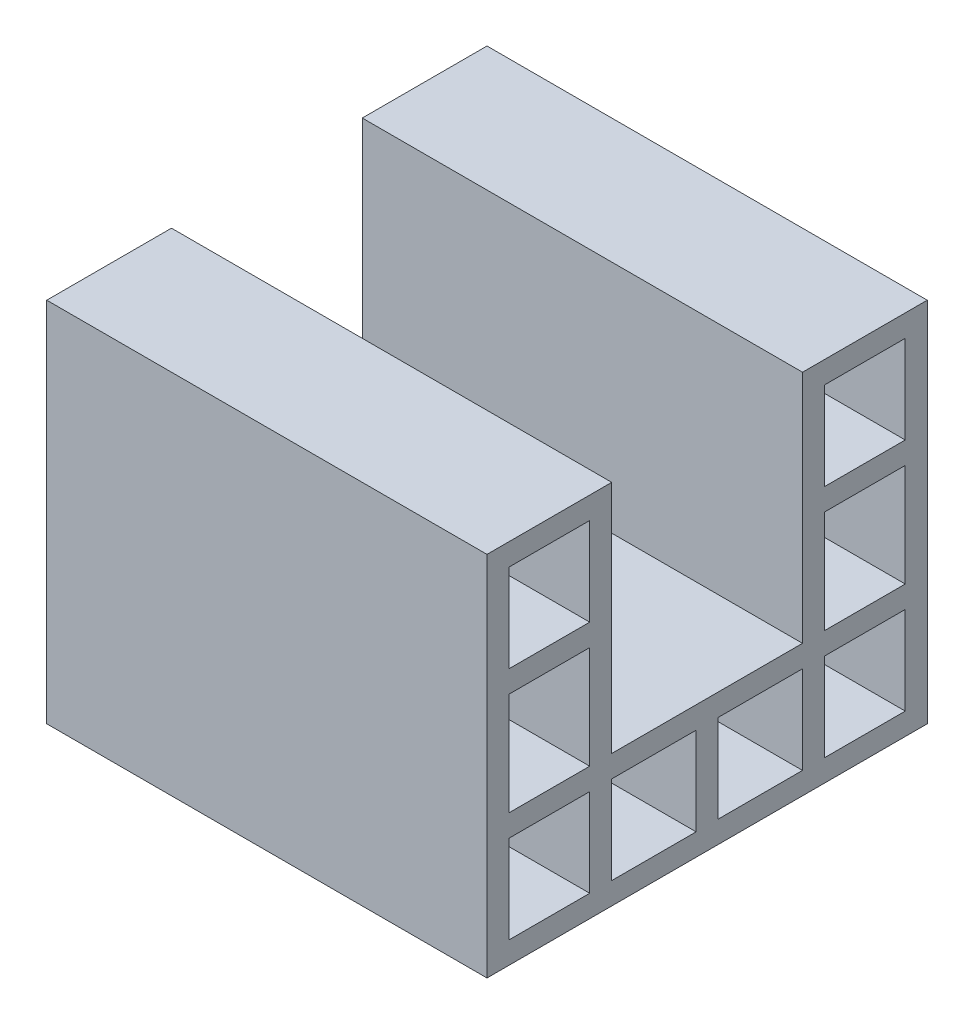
ISO-10303-21;
HEADER;
FILE_DESCRIPTION(('STEP AP214'),'2;1');
FILE_NAME('part.step','',(''),(''),'','','');
FILE_SCHEMA(('AUTOMOTIVE_DESIGN { 1 0 10303 214 1 1 1 1 }'));
ENDSEC;
DATA;
#1=APPLICATION_CONTEXT('core data for automotive mechanical design processes');
#2=APPLICATION_PROTOCOL_DEFINITION('international standard','automotive_design',2000,#1);
#3=PRODUCT_CONTEXT('',#1,'mechanical');
#4=PRODUCT('Part','Part','',(#3));
#5=PRODUCT_RELATED_PRODUCT_CATEGORY('part','',(#4));
#6=PRODUCT_DEFINITION_FORMATION('','',#4);
#7=PRODUCT_DEFINITION_CONTEXT('part definition',#1,'design');
#8=PRODUCT_DEFINITION('design','',#6,#7);
#9=PRODUCT_DEFINITION_SHAPE('','',#8);
#10=(LENGTH_UNIT() NAMED_UNIT(*) SI_UNIT(.MILLI.,.METRE.));
#11=(NAMED_UNIT(*) PLANE_ANGLE_UNIT() SI_UNIT($,.RADIAN.));
#12=(NAMED_UNIT(*) SI_UNIT($,.STERADIAN.) SOLID_ANGLE_UNIT());
#13=UNCERTAINTY_MEASURE_WITH_UNIT(LENGTH_MEASURE(1.E-05),#10,'distance_accuracy_value','');
#14=(GEOMETRIC_REPRESENTATION_CONTEXT(3) GLOBAL_UNCERTAINTY_ASSIGNED_CONTEXT((#13)) GLOBAL_UNIT_ASSIGNED_CONTEXT((#10,
#11,#12)) REPRESENTATION_CONTEXT('',''));
#15=CARTESIAN_POINT('',(0.,0.,0.));
#16=DIRECTION('',(0.,0.,1.));
#17=DIRECTION('',(1.,0.,0.));
#18=AXIS2_PLACEMENT_3D('',#15,#16,#17);
#19=CARTESIAN_POINT('',(30.,9.,-21.5));
#20=DIRECTION('',(-1.,0.,0.));
#21=DIRECTION('',(0.,0.,1.));
#22=AXIS2_PLACEMENT_3D('',#19,#20,#21);
#23=PLANE('',#22);
#24=DIRECTION('',(0.,0.,1.));
#25=VECTOR('',#24,1.);
#26=CARTESIAN_POINT('',(30.,16.,-28.5));
#27=LINE('',#26,#25);
#28=CARTESIAN_POINT('',(30.,16.,-28.5));
#29=VERTEX_POINT('',#28);
#30=CARTESIAN_POINT('',(30.,16.,-23.));
#31=VERTEX_POINT('',#30);
#32=EDGE_CURVE('E175',#29,#31,#27,.T.);
#33=ORIENTED_EDGE('',*,*,#32,.F.);
#34=DIRECTION('',(0.,1.,0.));
#35=VECTOR('',#34,1.);
#36=CARTESIAN_POINT('',(30.,16.,-28.5));
#37=LINE('',#36,#35);
#38=CARTESIAN_POINT('',(30.,9.,-28.5));
#39=VERTEX_POINT('',#38);
#40=EDGE_CURVE('E295',#39,#29,#37,.T.);
#41=ORIENTED_EDGE('',*,*,#40,.F.);
#42=DIRECTION('',(0.,0.,-1.));
#43=VECTOR('',#42,1.);
#44=CARTESIAN_POINT('',(30.,9.,-28.5));
#45=LINE('',#44,#43);
#46=CARTESIAN_POINT('',(30.,9.,-23.));
#47=VERTEX_POINT('',#46);
#48=EDGE_CURVE('E303',#47,#39,#45,.T.);
#49=ORIENTED_EDGE('',*,*,#48,.F.);
#50=DIRECTION('',(0.,-1.,0.));
#51=VECTOR('',#50,1.);
#52=CARTESIAN_POINT('',(30.,16.,-23.));
#53=LINE('',#52,#51);
#54=EDGE_CURVE('E307',#31,#47,#53,.T.);
#55=ORIENTED_EDGE('',*,*,#54,.F.);
#56=EDGE_LOOP('',(#33,#41,#49,#55));
#57=FACE_BOUND('',#56,.T.);
#58=DIRECTION('',(0.,0.,1.));
#59=VECTOR('',#58,1.);
#60=CARTESIAN_POINT('',(30.,7.5,-21.5));
#61=LINE('',#60,#59);
#62=CARTESIAN_POINT('',(30.,7.5,-21.5));
#63=VERTEX_POINT('',#62);
#64=CARTESIAN_POINT('',(30.,7.5,-15.75));
#65=VERTEX_POINT('',#64);
#66=EDGE_CURVE('E324',#63,#65,#61,.T.);
#67=ORIENTED_EDGE('',*,*,#66,.F.);
#68=DIRECTION('',(0.,1.,0.));
#69=VECTOR('',#68,1.);
#70=CARTESIAN_POINT('',(30.,7.5,-21.5));
#71=LINE('',#70,#69);
#72=CARTESIAN_POINT('',(30.,1.5,-21.5));
#73=VERTEX_POINT('',#72);
#74=EDGE_CURVE('E332',#73,#63,#71,.T.);
#75=ORIENTED_EDGE('',*,*,#74,.F.);
#76=DIRECTION('',(0.,0.,-1.));
#77=VECTOR('',#76,1.);
#78=CARTESIAN_POINT('',(30.,1.5,-21.5));
#79=LINE('',#78,#77);
#80=CARTESIAN_POINT('',(30.,1.5,-15.75));
#81=VERTEX_POINT('',#80);
#82=EDGE_CURVE('E329',#81,#73,#79,.T.);
#83=ORIENTED_EDGE('',*,*,#82,.F.);
#84=DIRECTION('',(0.,-1.,0.));
#85=VECTOR('',#84,1.);
#86=CARTESIAN_POINT('',(30.,7.5,-15.75));
#87=LINE('',#86,#85);
#88=EDGE_CURVE('E326',#65,#81,#87,.T.);
#89=ORIENTED_EDGE('',*,*,#88,.F.);
#90=EDGE_LOOP('',(#67,#75,#83,#89));
#91=FACE_BOUND('',#90,.T.);
#92=DIRECTION('',(0.,0.,-1.));
#93=VECTOR('',#92,1.);
#94=CARTESIAN_POINT('',(30.,17.5,-1.5));
#95=LINE('',#94,#93);
#96=CARTESIAN_POINT('',(30.,17.5,-1.5));
#97=VERTEX_POINT('',#96);
#98=CARTESIAN_POINT('',(30.,17.5,-7.));
#99=VERTEX_POINT('',#98);
#100=EDGE_CURVE('E346',#97,#99,#95,.T.);
#101=ORIENTED_EDGE('',*,*,#100,.F.);
#102=DIRECTION('',(0.,-1.,0.));
#103=VECTOR('',#102,1.);
#104=CARTESIAN_POINT('',(30.,17.5,-1.5));
#105=LINE('',#104,#103);
#106=CARTESIAN_POINT('',(30.,23.5,-1.5));
#107=VERTEX_POINT('',#106);
#108=EDGE_CURVE('E354',#107,#97,#105,.T.);
#109=ORIENTED_EDGE('',*,*,#108,.F.);
#110=DIRECTION('',(0.,0.,1.));
#111=VECTOR('',#110,1.);
#112=CARTESIAN_POINT('',(30.,23.5,-1.5));
#113=LINE('',#112,#111);
#114=CARTESIAN_POINT('',(30.,23.5,-7.));
#115=VERTEX_POINT('',#114);
#116=EDGE_CURVE('E351',#115,#107,#113,.T.);
#117=ORIENTED_EDGE('',*,*,#116,.F.);
#118=DIRECTION('',(0.,1.,0.));
#119=VECTOR('',#118,1.);
#120=CARTESIAN_POINT('',(30.,17.5,-7.));
#121=LINE('',#120,#119);
#122=EDGE_CURVE('E348',#99,#115,#121,.T.);
#123=ORIENTED_EDGE('',*,*,#122,.F.);
#124=EDGE_LOOP('',(#101,#109,#117,#123));
#125=FACE_BOUND('',#124,.T.);
#126=DIRECTION('',(0.,-1.,0.));
#127=VECTOR('',#126,1.);
#128=CARTESIAN_POINT('',(30.,7.5,-8.5));
#129=LINE('',#128,#127);
#130=CARTESIAN_POINT('',(30.,7.5,-8.5));
#131=VERTEX_POINT('',#130);
#132=CARTESIAN_POINT('',(30.,1.5,-8.5));
#133=VERTEX_POINT('',#132);
#134=EDGE_CURVE('E368',#131,#133,#129,.T.);
#135=ORIENTED_EDGE('',*,*,#134,.F.);
#136=DIRECTION('',(0.,0.,1.));
#137=VECTOR('',#136,1.);
#138=CARTESIAN_POINT('',(30.,7.5,-8.5));
#139=LINE('',#138,#137);
#140=CARTESIAN_POINT('',(30.,7.5,-14.25));
#141=VERTEX_POINT('',#140);
#142=EDGE_CURVE('E376',#141,#131,#139,.T.);
#143=ORIENTED_EDGE('',*,*,#142,.F.);
#144=DIRECTION('',(0.,1.,0.));
#145=VECTOR('',#144,1.);
#146=CARTESIAN_POINT('',(30.,7.5,-14.25));
#147=LINE('',#146,#145);
#148=CARTESIAN_POINT('',(30.,1.5,-14.25));
#149=VERTEX_POINT('',#148);
#150=EDGE_CURVE('E373',#149,#141,#147,.T.);
#151=ORIENTED_EDGE('',*,*,#150,.F.);
#152=DIRECTION('',(0.,0.,-1.));
#153=VECTOR('',#152,1.);
#154=CARTESIAN_POINT('',(30.,1.5,-8.5));
#155=LINE('',#154,#153);
#156=EDGE_CURVE('E370',#133,#149,#155,.T.);
#157=ORIENTED_EDGE('',*,*,#156,.F.);
#158=EDGE_LOOP('',(#135,#143,#151,#157));
#159=FACE_BOUND('',#158,.T.);
#160=DIRECTION('',(0.,-1.,0.));
#161=VECTOR('',#160,1.);
#162=CARTESIAN_POINT('',(30.,9.,-21.5));
#163=LINE('',#162,#161);
#164=CARTESIAN_POINT('',(30.,25.,-21.5));
#165=VERTEX_POINT('',#164);
#166=CARTESIAN_POINT('',(30.,9.,-21.5));
#167=VERTEX_POINT('',#166);
#168=EDGE_CURVE('E397',#165,#167,#163,.T.);
#169=ORIENTED_EDGE('',*,*,#168,.T.);
#170=DIRECTION('',(0.,0.,1.));
#171=VECTOR('',#170,1.);
#172=CARTESIAN_POINT('',(30.,9.,-8.5));
#173=LINE('',#172,#171);
#174=CARTESIAN_POINT('',(30.,9.,-8.5));
#175=VERTEX_POINT('',#174);
#176=EDGE_CURVE('E400',#167,#175,#173,.T.);
#177=ORIENTED_EDGE('',*,*,#176,.T.);
#178=DIRECTION('',(0.,1.,0.));
#179=VECTOR('',#178,1.);
#180=CARTESIAN_POINT('',(30.,9.,-8.5));
#181=LINE('',#180,#179);
#182=CARTESIAN_POINT('',(30.,25.,-8.5));
#183=VERTEX_POINT('',#182);
#184=EDGE_CURVE('E402',#175,#183,#181,.T.);
#185=ORIENTED_EDGE('',*,*,#184,.T.);
#186=DIRECTION('',(0.,0.,1.));
#187=VECTOR('',#186,1.);
#188=CARTESIAN_POINT('',(30.,25.,-8.5));
#189=LINE('',#188,#187);
#190=CARTESIAN_POINT('',(30.,25.,0.));
#191=VERTEX_POINT('',#190);
#192=EDGE_CURVE('E404',#183,#191,#189,.T.);
#193=ORIENTED_EDGE('',*,*,#192,.T.);
#194=DIRECTION('',(0.,-1.,0.));
#195=VECTOR('',#194,1.);
#196=CARTESIAN_POINT('',(30.,25.,0.));
#197=LINE('',#196,#195);
#198=CARTESIAN_POINT('',(30.,0.,0.));
#199=VERTEX_POINT('',#198);
#200=EDGE_CURVE('E406',#191,#199,#197,.T.);
#201=ORIENTED_EDGE('',*,*,#200,.T.);
#202=DIRECTION('',(0.,0.,-1.));
#203=VECTOR('',#202,1.);
#204=CARTESIAN_POINT('',(30.,0.,0.));
#205=LINE('',#204,#203);
#206=CARTESIAN_POINT('',(30.,0.,-30.));
#207=VERTEX_POINT('',#206);
#208=EDGE_CURVE('E408',#199,#207,#205,.T.);
#209=ORIENTED_EDGE('',*,*,#208,.T.);
#210=DIRECTION('',(0.,1.,0.));
#211=VECTOR('',#210,1.);
#212=CARTESIAN_POINT('',(30.,25.,-30.));
#213=LINE('',#212,#211);
#214=CARTESIAN_POINT('',(30.,25.,-30.));
#215=VERTEX_POINT('',#214);
#216=EDGE_CURVE('E410',#207,#215,#213,.T.);
#217=ORIENTED_EDGE('',*,*,#216,.T.);
#218=DIRECTION('',(0.,0.,1.));
#219=VECTOR('',#218,1.);
#220=CARTESIAN_POINT('',(30.,25.,-21.5));
#221=LINE('',#220,#219);
#222=EDGE_CURVE('E412',#215,#165,#221,.T.);
#223=ORIENTED_EDGE('',*,*,#222,.T.);
#224=EDGE_LOOP('',(#169,#177,#185,#193,#201,#209,#217,#223));
#225=FACE_BOUND('',#224,.T.);
#226=DIRECTION('',(0.,-1.,0.));
#227=VECTOR('',#226,1.);
#228=CARTESIAN_POINT('',(30.,7.5,-1.5));
#229=LINE('',#228,#227);
#230=CARTESIAN_POINT('',(30.,7.5,-1.5));
#231=VERTEX_POINT('',#230);
#232=CARTESIAN_POINT('',(30.,1.5,-1.5));
#233=VERTEX_POINT('',#232);
#234=EDGE_CURVE('E357',#231,#233,#229,.T.);
#235=ORIENTED_EDGE('',*,*,#234,.F.);
#236=DIRECTION('',(0.,0.,1.));
#237=VECTOR('',#236,1.);
#238=CARTESIAN_POINT('',(30.,7.5,-1.5));
#239=LINE('',#238,#237);
#240=CARTESIAN_POINT('',(30.,7.5,-7.));
#241=VERTEX_POINT('',#240);
#242=EDGE_CURVE('E365',#241,#231,#239,.T.);
#243=ORIENTED_EDGE('',*,*,#242,.F.);
#244=DIRECTION('',(0.,1.,0.));
#245=VECTOR('',#244,1.);
#246=CARTESIAN_POINT('',(30.,7.5,-7.));
#247=LINE('',#246,#245);
#248=CARTESIAN_POINT('',(30.,1.5,-7.));
#249=VERTEX_POINT('',#248);
#250=EDGE_CURVE('E362',#249,#241,#247,.T.);
#251=ORIENTED_EDGE('',*,*,#250,.F.);
#252=DIRECTION('',(0.,0.,-1.));
#253=VECTOR('',#252,1.);
#254=CARTESIAN_POINT('',(30.,1.5,-1.5));
#255=LINE('',#254,#253);
#256=EDGE_CURVE('E359',#233,#249,#255,.T.);
#257=ORIENTED_EDGE('',*,*,#256,.F.);
#258=EDGE_LOOP('',(#235,#243,#251,#257));
#259=FACE_BOUND('',#258,.T.);
#260=DIRECTION('',(0.,1.,0.));
#261=VECTOR('',#260,1.);
#262=CARTESIAN_POINT('',(30.,16.,-7.));
#263=LINE('',#262,#261);
#264=CARTESIAN_POINT('',(30.,9.,-7.));
#265=VERTEX_POINT('',#264);
#266=CARTESIAN_POINT('',(30.,16.,-7.));
#267=VERTEX_POINT('',#266);
#268=EDGE_CURVE('E335',#265,#267,#263,.T.);
#269=ORIENTED_EDGE('',*,*,#268,.F.);
#270=DIRECTION('',(0.,0.,-1.));
#271=VECTOR('',#270,1.);
#272=CARTESIAN_POINT('',(30.,9.,-1.5));
#273=LINE('',#272,#271);
#274=CARTESIAN_POINT('',(30.,9.,-1.5));
#275=VERTEX_POINT('',#274);
#276=EDGE_CURVE('E343',#275,#265,#273,.T.);
#277=ORIENTED_EDGE('',*,*,#276,.F.);
#278=DIRECTION('',(0.,-1.,0.));
#279=VECTOR('',#278,1.);
#280=CARTESIAN_POINT('',(30.,16.,-1.5));
#281=LINE('',#280,#279);
#282=CARTESIAN_POINT('',(30.,16.,-1.5));
#283=VERTEX_POINT('',#282);
#284=EDGE_CURVE('E340',#283,#275,#281,.T.);
#285=ORIENTED_EDGE('',*,*,#284,.F.);
#286=DIRECTION('',(0.,0.,1.));
#287=VECTOR('',#286,1.);
#288=CARTESIAN_POINT('',(30.,16.,-1.5));
#289=LINE('',#288,#287);
#290=EDGE_CURVE('E337',#267,#283,#289,.T.);
#291=ORIENTED_EDGE('',*,*,#290,.F.);
#292=EDGE_LOOP('',(#269,#277,#285,#291));
#293=FACE_BOUND('',#292,.T.);
#294=DIRECTION('',(0.,1.,0.));
#295=VECTOR('',#294,1.);
#296=CARTESIAN_POINT('',(30.,17.5,-28.5));
#297=LINE('',#296,#295);
#298=CARTESIAN_POINT('',(30.,17.5,-28.5));
#299=VERTEX_POINT('',#298);
#300=CARTESIAN_POINT('',(30.,23.5,-28.5));
#301=VERTEX_POINT('',#300);
#302=EDGE_CURVE('E314',#299,#301,#297,.T.);
#303=ORIENTED_EDGE('',*,*,#302,.F.);
#304=DIRECTION('',(0.,0.,-1.));
#305=VECTOR('',#304,1.);
#306=CARTESIAN_POINT('',(30.,17.5,-28.5));
#307=LINE('',#306,#305);
#308=CARTESIAN_POINT('',(30.,17.5,-23.));
#309=VERTEX_POINT('',#308);
#310=EDGE_CURVE('E321',#309,#299,#307,.T.);
#311=ORIENTED_EDGE('',*,*,#310,.F.);
#312=DIRECTION('',(0.,-1.,0.));
#313=VECTOR('',#312,1.);
#314=CARTESIAN_POINT('',(30.,17.5,-23.));
#315=LINE('',#314,#313);
#316=CARTESIAN_POINT('',(30.,23.5,-23.));
#317=VERTEX_POINT('',#316);
#318=EDGE_CURVE('E319',#317,#309,#315,.T.);
#319=ORIENTED_EDGE('',*,*,#318,.F.);
#320=DIRECTION('',(0.,0.,1.));
#321=VECTOR('',#320,1.);
#322=CARTESIAN_POINT('',(30.,23.5,-28.5));
#323=LINE('',#322,#321);
#324=EDGE_CURVE('E316',#301,#317,#323,.T.);
#325=ORIENTED_EDGE('',*,*,#324,.F.);
#326=EDGE_LOOP('',(#303,#311,#319,#325));
#327=FACE_BOUND('',#326,.T.);
#328=DIRECTION('',(0.,0.,1.));
#329=VECTOR('',#328,1.);
#330=CARTESIAN_POINT('',(30.,7.5,-28.5));
#331=LINE('',#330,#329);
#332=CARTESIAN_POINT('',(30.,7.5,-28.5));
#333=VERTEX_POINT('',#332);
#334=CARTESIAN_POINT('',(30.,7.5,-23.));
#335=VERTEX_POINT('',#334);
#336=EDGE_CURVE('E574',#333,#335,#331,.T.);
#337=ORIENTED_EDGE('',*,*,#336,.F.);
#338=DIRECTION('',(0.,1.,0.));
#339=VECTOR('',#338,1.);
#340=CARTESIAN_POINT('',(30.,7.5,-28.5));
#341=LINE('',#340,#339);
#342=CARTESIAN_POINT('',(30.,1.49999999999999,-28.5));
#343=VERTEX_POINT('',#342);
#344=EDGE_CURVE('E556',#343,#333,#341,.T.);
#345=ORIENTED_EDGE('',*,*,#344,.F.);
#346=DIRECTION('',(0.,0.,-1.));
#347=VECTOR('',#346,1.);
#348=CARTESIAN_POINT('',(30.,1.49999999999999,-28.5));
#349=LINE('',#348,#347);
#350=CARTESIAN_POINT('',(30.,1.49999999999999,-23.));
#351=VERTEX_POINT('',#350);
#352=EDGE_CURVE('E586',#351,#343,#349,.T.);
#353=ORIENTED_EDGE('',*,*,#352,.F.);
#354=DIRECTION('',(0.,-1.,0.));
#355=VECTOR('',#354,1.);
#356=CARTESIAN_POINT('',(30.,7.5,-23.));
#357=LINE('',#356,#355);
#358=EDGE_CURVE('E588',#335,#351,#357,.T.);
#359=ORIENTED_EDGE('',*,*,#358,.F.);
#360=EDGE_LOOP('',(#337,#345,#353,#359));
#361=FACE_BOUND('',#360,.T.);
#362=ADVANCED_FACE('F26',(#57,#91,#125,#159,#225,#259,#293,#327,#361),#23,.F.);
#363=CARTESIAN_POINT('',(0.,9.,-21.5));
#364=DIRECTION('',(-1.,0.,0.));
#365=DIRECTION('',(0.,0.,1.));
#366=AXIS2_PLACEMENT_3D('',#363,#364,#365);
#367=PLANE('',#366);
#368=DIRECTION('',(0.,1.,0.));
#369=VECTOR('',#368,1.);
#370=CARTESIAN_POINT('',(0.,9.,-27.9763480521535));
#371=LINE('',#370,#369);
#372=CARTESIAN_POINT('',(0.,9.52365194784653,-27.9763480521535));
#373=VERTEX_POINT('',#372);
#374=CARTESIAN_POINT('',(0.,15.4763480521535,-27.9763480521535));
#375=VERTEX_POINT('',#374);
#376=EDGE_CURVE('E30',#373,#375,#371,.T.);
#377=ORIENTED_EDGE('',*,*,#376,.T.);
#378=DIRECTION('',(0.,0.,1.));
#379=VECTOR('',#378,1.);
#380=CARTESIAN_POINT('',(0.,15.4763480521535,-21.5));
#381=LINE('',#380,#379);
#382=CARTESIAN_POINT('',(0.,15.4763480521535,-23.5236519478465));
#383=VERTEX_POINT('',#382);
#384=EDGE_CURVE('E290',#375,#383,#381,.T.);
#385=ORIENTED_EDGE('',*,*,#384,.T.);
#386=DIRECTION('',(0.,-1.,0.));
#387=VECTOR('',#386,1.);
#388=CARTESIAN_POINT('',(0.,9.,-23.5236519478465));
#389=LINE('',#388,#387);
#390=CARTESIAN_POINT('',(0.,9.52365194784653,-23.5236519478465));
#391=VERTEX_POINT('',#390);
#392=EDGE_CURVE('E579',#383,#391,#389,.T.);
#393=ORIENTED_EDGE('',*,*,#392,.T.);
#394=DIRECTION('',(0.,0.,-1.));
#395=VECTOR('',#394,1.);
#396=CARTESIAN_POINT('',(0.,9.52365194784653,-21.5));
#397=LINE('',#396,#395);
#398=EDGE_CURVE('E581',#391,#373,#397,.T.);
#399=ORIENTED_EDGE('',*,*,#398,.T.);
#400=EDGE_LOOP('',(#377,#385,#393,#399));
#401=FACE_BOUND('',#400,.T.);
#402=DIRECTION('',(0.,1.,0.));
#403=VECTOR('',#402,1.);
#404=CARTESIAN_POINT('',(0.,9.,-20.9763480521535));
#405=LINE('',#404,#403);
#406=CARTESIAN_POINT('',(0.,2.02365194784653,-20.9763480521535));
#407=VERTEX_POINT('',#406);
#408=CARTESIAN_POINT('',(0.,6.97634805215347,-20.9763480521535));
#409=VERTEX_POINT('',#408);
#410=EDGE_CURVE('E327',#407,#409,#405,.T.);
#411=ORIENTED_EDGE('',*,*,#410,.T.);
#412=DIRECTION('',(0.,0.,1.));
#413=VECTOR('',#412,1.);
#414=CARTESIAN_POINT('',(0.,6.97634805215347,-21.5));
#415=LINE('',#414,#413);
#416=CARTESIAN_POINT('',(0.,6.97634805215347,-16.2736519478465));
#417=VERTEX_POINT('',#416);
#418=EDGE_CURVE('E437',#409,#417,#415,.T.);
#419=ORIENTED_EDGE('',*,*,#418,.T.);
#420=DIRECTION('',(0.,-1.,0.));
#421=VECTOR('',#420,1.);
#422=CARTESIAN_POINT('',(0.,8.99999999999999,-16.2736519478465));
#423=LINE('',#422,#421);
#424=CARTESIAN_POINT('',(0.,2.02365194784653,-16.2736519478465));
#425=VERTEX_POINT('',#424);
#426=EDGE_CURVE('E545',#417,#425,#423,.T.);
#427=ORIENTED_EDGE('',*,*,#426,.T.);
#428=DIRECTION('',(0.,0.,-1.));
#429=VECTOR('',#428,1.);
#430=CARTESIAN_POINT('',(0.,2.02365194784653,-21.5));
#431=LINE('',#430,#429);
#432=EDGE_CURVE('E548',#425,#407,#431,.T.);
#433=ORIENTED_EDGE('',*,*,#432,.T.);
#434=EDGE_LOOP('',(#411,#419,#427,#433));
#435=FACE_BOUND('',#434,.T.);
#436=DIRECTION('',(0.,-1.,0.));
#437=VECTOR('',#436,1.);
#438=CARTESIAN_POINT('',(0.,9.00000000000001,-2.02365194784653));
#439=LINE('',#438,#437);
#440=CARTESIAN_POINT('',(0.,22.9763480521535,-2.02365194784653));
#441=VERTEX_POINT('',#440);
#442=CARTESIAN_POINT('',(0.,18.0236519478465,-2.02365194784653));
#443=VERTEX_POINT('',#442);
#444=EDGE_CURVE('E349',#441,#443,#439,.T.);
#445=ORIENTED_EDGE('',*,*,#444,.T.);
#446=DIRECTION('',(0.,0.,-1.));
#447=VECTOR('',#446,1.);
#448=CARTESIAN_POINT('',(0.,18.0236519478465,-21.5));
#449=LINE('',#448,#447);
#450=CARTESIAN_POINT('',(0.,18.0236519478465,-6.47634805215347));
#451=VERTEX_POINT('',#450);
#452=EDGE_CURVE('E480',#443,#451,#449,.T.);
#453=ORIENTED_EDGE('',*,*,#452,.T.);
#454=DIRECTION('',(0.,1.,0.));
#455=VECTOR('',#454,1.);
#456=CARTESIAN_POINT('',(0.,9.,-6.47634805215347));
#457=LINE('',#456,#455);
#458=CARTESIAN_POINT('',(0.,22.9763480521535,-6.47634805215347));
#459=VERTEX_POINT('',#458);
#460=EDGE_CURVE('E510',#451,#459,#457,.T.);
#461=ORIENTED_EDGE('',*,*,#460,.T.);
#462=DIRECTION('',(0.,0.,1.));
#463=VECTOR('',#462,1.);
#464=CARTESIAN_POINT('',(0.,22.9763480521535,-21.5));
#465=LINE('',#464,#463);
#466=EDGE_CURVE('E507',#459,#441,#465,.T.);
#467=ORIENTED_EDGE('',*,*,#466,.T.);
#468=EDGE_LOOP('',(#445,#453,#461,#467));
#469=FACE_BOUND('',#468,.T.);
#470=DIRECTION('',(0.,0.,1.));
#471=VECTOR('',#470,1.);
#472=CARTESIAN_POINT('',(0.,6.97634805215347,-21.5));
#473=LINE('',#472,#471);
#474=CARTESIAN_POINT('',(0.,6.97634805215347,-13.7263480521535));
#475=VERTEX_POINT('',#474);
#476=CARTESIAN_POINT('',(0.,6.97634805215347,-9.02365194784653));
#477=VERTEX_POINT('',#476);
#478=EDGE_CURVE('E371',#475,#477,#473,.T.);
#479=ORIENTED_EDGE('',*,*,#478,.T.);
#480=DIRECTION('',(0.,-1.,0.));
#481=VECTOR('',#480,1.);
#482=CARTESIAN_POINT('',(0.,9.,-9.02365194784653));
#483=LINE('',#482,#481);
#484=CARTESIAN_POINT('',(0.,2.02365194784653,-9.02365194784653));
#485=VERTEX_POINT('',#484);
#486=EDGE_CURVE('E463',#477,#485,#483,.T.);
#487=ORIENTED_EDGE('',*,*,#486,.T.);
#488=DIRECTION('',(0.,0.,-1.));
#489=VECTOR('',#488,1.);
#490=CARTESIAN_POINT('',(0.,2.02365194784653,-21.5));
#491=LINE('',#490,#489);
#492=CARTESIAN_POINT('',(0.,2.02365194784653,-13.7263480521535));
#493=VERTEX_POINT('',#492);
#494=EDGE_CURVE('E530',#485,#493,#491,.T.);
#495=ORIENTED_EDGE('',*,*,#494,.T.);
#496=DIRECTION('',(0.,1.,0.));
#497=VECTOR('',#496,1.);
#498=CARTESIAN_POINT('',(0.,9.,-13.7263480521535));
#499=LINE('',#498,#497);
#500=EDGE_CURVE('E527',#493,#475,#499,.T.);
#501=ORIENTED_EDGE('',*,*,#500,.T.);
#502=EDGE_LOOP('',(#479,#487,#495,#501));
#503=FACE_BOUND('',#502,.T.);
#504=DIRECTION('',(0.,-1.,0.));
#505=VECTOR('',#504,1.);
#506=CARTESIAN_POINT('',(0.,9.,-21.5));
#507=LINE('',#506,#505);
#508=CARTESIAN_POINT('',(0.,25.,-21.5));
#509=VERTEX_POINT('',#508);
#510=CARTESIAN_POINT('',(0.,9.,-21.5));
#511=VERTEX_POINT('',#510);
#512=EDGE_CURVE('E379',#509,#511,#507,.T.);
#513=ORIENTED_EDGE('',*,*,#512,.F.);
#514=DIRECTION('',(0.,0.,1.));
#515=VECTOR('',#514,1.);
#516=CARTESIAN_POINT('',(0.,25.,-21.5));
#517=LINE('',#516,#515);
#518=CARTESIAN_POINT('',(0.,25.,-30.));
#519=VERTEX_POINT('',#518);
#520=EDGE_CURVE('E395',#519,#509,#517,.T.);
#521=ORIENTED_EDGE('',*,*,#520,.F.);
#522=DIRECTION('',(0.,1.,0.));
#523=VECTOR('',#522,1.);
#524=CARTESIAN_POINT('',(0.,25.,-30.));
#525=LINE('',#524,#523);
#526=CARTESIAN_POINT('',(0.,0.,-30.));
#527=VERTEX_POINT('',#526);
#528=EDGE_CURVE('E393',#527,#519,#525,.T.);
#529=ORIENTED_EDGE('',*,*,#528,.F.);
#530=DIRECTION('',(0.,0.,-1.));
#531=VECTOR('',#530,1.);
#532=CARTESIAN_POINT('',(0.,0.,0.));
#533=LINE('',#532,#531);
#534=CARTESIAN_POINT('',(0.,0.,0.));
#535=VERTEX_POINT('',#534);
#536=EDGE_CURVE('E391',#535,#527,#533,.T.);
#537=ORIENTED_EDGE('',*,*,#536,.F.);
#538=DIRECTION('',(0.,-1.,0.));
#539=VECTOR('',#538,1.);
#540=CARTESIAN_POINT('',(0.,25.,0.));
#541=LINE('',#540,#539);
#542=CARTESIAN_POINT('',(0.,25.,0.));
#543=VERTEX_POINT('',#542);
#544=EDGE_CURVE('E389',#543,#535,#541,.T.);
#545=ORIENTED_EDGE('',*,*,#544,.F.);
#546=DIRECTION('',(0.,0.,1.));
#547=VECTOR('',#546,1.);
#548=CARTESIAN_POINT('',(0.,25.,-8.5));
#549=LINE('',#548,#547);
#550=CARTESIAN_POINT('',(0.,25.,-8.5));
#551=VERTEX_POINT('',#550);
#552=EDGE_CURVE('E387',#551,#543,#549,.T.);
#553=ORIENTED_EDGE('',*,*,#552,.F.);
#554=DIRECTION('',(0.,1.,0.));
#555=VECTOR('',#554,1.);
#556=CARTESIAN_POINT('',(0.,9.,-8.5));
#557=LINE('',#556,#555);
#558=CARTESIAN_POINT('',(0.,9.,-8.5));
#559=VERTEX_POINT('',#558);
#560=EDGE_CURVE('E385',#559,#551,#557,.T.);
#561=ORIENTED_EDGE('',*,*,#560,.F.);
#562=DIRECTION('',(0.,0.,1.));
#563=VECTOR('',#562,1.);
#564=CARTESIAN_POINT('',(0.,9.,-8.5));
#565=LINE('',#564,#563);
#566=EDGE_CURVE('E382',#511,#559,#565,.T.);
#567=ORIENTED_EDGE('',*,*,#566,.F.);
#568=EDGE_LOOP('',(#513,#521,#529,#537,#545,#553,#561,#567));
#569=FACE_BOUND('',#568,.T.);
#570=DIRECTION('',(0.,0.,1.));
#571=VECTOR('',#570,1.);
#572=CARTESIAN_POINT('',(0.,6.97634805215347,-21.5));
#573=LINE('',#572,#571);
#574=CARTESIAN_POINT('',(0.,6.97634805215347,-6.47634805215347));
#575=VERTEX_POINT('',#574);
#576=CARTESIAN_POINT('',(0.,6.97634805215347,-2.02365194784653));
#577=VERTEX_POINT('',#576);
#578=EDGE_CURVE('E360',#575,#577,#573,.T.);
#579=ORIENTED_EDGE('',*,*,#578,.T.);
#580=DIRECTION('',(0.,-1.,0.));
#581=VECTOR('',#580,1.);
#582=CARTESIAN_POINT('',(0.,9.,-2.02365194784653));
#583=LINE('',#582,#581);
#584=CARTESIAN_POINT('',(0.,2.02365194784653,-2.02365194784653));
#585=VERTEX_POINT('',#584);
#586=EDGE_CURVE('E468',#577,#585,#583,.T.);
#587=ORIENTED_EDGE('',*,*,#586,.T.);
#588=DIRECTION('',(0.,0.,-1.));
#589=VECTOR('',#588,1.);
#590=CARTESIAN_POINT('',(0.,2.02365194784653,-21.5));
#591=LINE('',#590,#589);
#592=CARTESIAN_POINT('',(0.,2.02365194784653,-6.47634805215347));
#593=VERTEX_POINT('',#592);
#594=EDGE_CURVE('E471',#585,#593,#591,.T.);
#595=ORIENTED_EDGE('',*,*,#594,.T.);
#596=DIRECTION('',(0.,1.,0.));
#597=VECTOR('',#596,1.);
#598=CARTESIAN_POINT('',(0.,9.,-6.47634805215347));
#599=LINE('',#598,#597);
#600=EDGE_CURVE('E467',#593,#575,#599,.T.);
#601=ORIENTED_EDGE('',*,*,#600,.T.);
#602=EDGE_LOOP('',(#579,#587,#595,#601));
#603=FACE_BOUND('',#602,.T.);
#604=DIRECTION('',(0.,0.,-1.));
#605=VECTOR('',#604,1.);
#606=CARTESIAN_POINT('',(0.,9.52365194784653,-21.5));
#607=LINE('',#606,#605);
#608=CARTESIAN_POINT('',(0.,9.52365194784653,-2.02365194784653));
#609=VERTEX_POINT('',#608);
#610=CARTESIAN_POINT('',(0.,9.52365194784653,-6.47634805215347));
#611=VERTEX_POINT('',#610);
#612=EDGE_CURVE('E338',#609,#611,#607,.T.);
#613=ORIENTED_EDGE('',*,*,#612,.T.);
#614=DIRECTION('',(0.,1.,0.));
#615=VECTOR('',#614,1.);
#616=CARTESIAN_POINT('',(0.,9.,-6.47634805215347));
#617=LINE('',#616,#615);
#618=CARTESIAN_POINT('',(0.,15.4763480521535,-6.47634805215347));
#619=VERTEX_POINT('',#618);
#620=EDGE_CURVE('E491',#611,#619,#617,.T.);
#621=ORIENTED_EDGE('',*,*,#620,.T.);
#622=DIRECTION('',(0.,0.,1.));
#623=VECTOR('',#622,1.);
#624=CARTESIAN_POINT('',(0.,15.4763480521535,-21.5));
#625=LINE('',#624,#623);
#626=CARTESIAN_POINT('',(0.,15.4763480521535,-2.02365194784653));
#627=VERTEX_POINT('',#626);
#628=EDGE_CURVE('E487',#619,#627,#625,.T.);
#629=ORIENTED_EDGE('',*,*,#628,.T.);
#630=DIRECTION('',(0.,-1.,0.));
#631=VECTOR('',#630,1.);
#632=CARTESIAN_POINT('',(0.,9.,-2.02365194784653));
#633=LINE('',#632,#631);
#634=EDGE_CURVE('E490',#627,#609,#633,.T.);
#635=ORIENTED_EDGE('',*,*,#634,.T.);
#636=EDGE_LOOP('',(#613,#621,#629,#635));
#637=FACE_BOUND('',#636,.T.);
#638=DIRECTION('',(0.,0.,-1.));
#639=VECTOR('',#638,1.);
#640=CARTESIAN_POINT('',(0.,18.0236519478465,-21.5));
#641=LINE('',#640,#639);
#642=CARTESIAN_POINT('',(0.,18.0236519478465,-23.5236519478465));
#643=VERTEX_POINT('',#642);
#644=CARTESIAN_POINT('',(0.,18.0236519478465,-27.9763480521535));
#645=VERTEX_POINT('',#644);
#646=EDGE_CURVE('E317',#643,#645,#641,.T.);
#647=ORIENTED_EDGE('',*,*,#646,.T.);
#648=DIRECTION('',(0.,1.,0.));
#649=VECTOR('',#648,1.);
#650=CARTESIAN_POINT('',(0.,8.99999999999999,-27.9763480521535));
#651=LINE('',#650,#649);
#652=CARTESIAN_POINT('',(0.,22.9763480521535,-27.9763480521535));
#653=VERTEX_POINT('',#652);
#654=EDGE_CURVE('E447',#645,#653,#651,.T.);
#655=ORIENTED_EDGE('',*,*,#654,.T.);
#656=DIRECTION('',(0.,0.,1.));
#657=VECTOR('',#656,1.);
#658=CARTESIAN_POINT('',(0.,22.9763480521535,-21.5));
#659=LINE('',#658,#657);
#660=CARTESIAN_POINT('',(0.,22.9763480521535,-23.5236519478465));
#661=VERTEX_POINT('',#660);
#662=EDGE_CURVE('E443',#653,#661,#659,.T.);
#663=ORIENTED_EDGE('',*,*,#662,.T.);
#664=DIRECTION('',(0.,-1.,0.));
#665=VECTOR('',#664,1.);
#666=CARTESIAN_POINT('',(0.,9.,-23.5236519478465));
#667=LINE('',#666,#665);
#668=EDGE_CURVE('E446',#661,#643,#667,.T.);
#669=ORIENTED_EDGE('',*,*,#668,.T.);
#670=EDGE_LOOP('',(#647,#655,#663,#669));
#671=FACE_BOUND('',#670,.T.);
#672=DIRECTION('',(0.,1.,0.));
#673=VECTOR('',#672,1.);
#674=CARTESIAN_POINT('',(0.,9.00000000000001,-27.9763480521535));
#675=LINE('',#674,#673);
#676=CARTESIAN_POINT('',(0.,2.02365194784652,-27.9763480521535));
#677=VERTEX_POINT('',#676);
#678=CARTESIAN_POINT('',(0.,6.97634805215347,-27.9763480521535));
#679=VERTEX_POINT('',#678);
#680=EDGE_CURVE('E572',#677,#679,#675,.T.);
#681=ORIENTED_EDGE('',*,*,#680,.T.);
#682=DIRECTION('',(0.,0.,1.));
#683=VECTOR('',#682,1.);
#684=CARTESIAN_POINT('',(0.,6.97634805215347,-21.5));
#685=LINE('',#684,#683);
#686=CARTESIAN_POINT('',(0.,6.97634805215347,-23.5236519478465));
#687=VERTEX_POINT('',#686);
#688=EDGE_CURVE('E563',#679,#687,#685,.T.);
#689=ORIENTED_EDGE('',*,*,#688,.T.);
#690=DIRECTION('',(0.,-1.,0.));
#691=VECTOR('',#690,1.);
#692=CARTESIAN_POINT('',(0.,9.,-23.5236519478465));
#693=LINE('',#692,#691);
#694=CARTESIAN_POINT('',(0.,2.02365194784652,-23.5236519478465));
#695=VERTEX_POINT('',#694);
#696=EDGE_CURVE('E566',#687,#695,#693,.T.);
#697=ORIENTED_EDGE('',*,*,#696,.T.);
#698=DIRECTION('',(0.,0.,-1.));
#699=VECTOR('',#698,1.);
#700=CARTESIAN_POINT('',(0.,2.02365194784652,-21.5));
#701=LINE('',#700,#699);
#702=EDGE_CURVE('E569',#695,#677,#701,.T.);
#703=ORIENTED_EDGE('',*,*,#702,.T.);
#704=EDGE_LOOP('',(#681,#689,#697,#703));
#705=FACE_BOUND('',#704,.T.);
#706=ADVANCED_FACE('F610',(#401,#435,#469,#503,#569,#603,#637,#671,#705),#367,.T.);
#707=CARTESIAN_POINT('',(30.,9.,-21.5));
#708=DIRECTION('',(0.,0.,-1.));
#709=DIRECTION('',(0.,1.,0.));
#710=AXIS2_PLACEMENT_3D('',#707,#708,#709);
#711=PLANE('',#710);
#712=ORIENTED_EDGE('',*,*,#512,.T.);
#713=DIRECTION('',(-1.,0.,0.));
#714=VECTOR('',#713,1.);
#715=CARTESIAN_POINT('',(30.,9.,-21.5));
#716=LINE('',#715,#714);
#717=EDGE_CURVE('E11',#167,#511,#716,.T.);
#718=ORIENTED_EDGE('',*,*,#717,.F.);
#719=ORIENTED_EDGE('',*,*,#168,.F.);
#720=DIRECTION('',(-1.,0.,0.));
#721=VECTOR('',#720,1.);
#722=CARTESIAN_POINT('',(30.,25.,-21.5));
#723=LINE('',#722,#721);
#724=EDGE_CURVE('E414',#165,#509,#723,.T.);
#725=ORIENTED_EDGE('',*,*,#724,.T.);
#726=EDGE_LOOP('',(#712,#718,#719,#725));
#727=FACE_BOUND('',#726,.T.);
#728=ADVANCED_FACE('F625',(#727),#711,.F.);
#729=CARTESIAN_POINT('',(30.,9.,-8.5));
#730=DIRECTION('',(0.,-1.,0.));
#731=DIRECTION('',(0.,0.,-1.));
#732=AXIS2_PLACEMENT_3D('',#729,#730,#731);
#733=PLANE('',#732);
#734=ORIENTED_EDGE('',*,*,#566,.T.);
#735=DIRECTION('',(-1.,0.,0.));
#736=VECTOR('',#735,1.);
#737=CARTESIAN_POINT('',(30.,9.,-8.5));
#738=LINE('',#737,#736);
#739=EDGE_CURVE('E36',#175,#559,#738,.T.);
#740=ORIENTED_EDGE('',*,*,#739,.F.);
#741=ORIENTED_EDGE('',*,*,#176,.F.);
#742=ORIENTED_EDGE('',*,*,#717,.T.);
#743=EDGE_LOOP('',(#734,#740,#741,#742));
#744=FACE_BOUND('',#743,.T.);
#745=ADVANCED_FACE('F652',(#744),#733,.F.);
#746=CARTESIAN_POINT('',(30.,9.,-8.5));
#747=DIRECTION('',(0.,0.,1.));
#748=DIRECTION('',(1.,0.,0.));
#749=AXIS2_PLACEMENT_3D('',#746,#747,#748);
#750=PLANE('',#749);
#751=ORIENTED_EDGE('',*,*,#560,.T.);
#752=DIRECTION('',(-1.,0.,0.));
#753=VECTOR('',#752,1.);
#754=CARTESIAN_POINT('',(30.,25.,-8.5));
#755=LINE('',#754,#753);
#756=EDGE_CURVE('E429',#183,#551,#755,.T.);
#757=ORIENTED_EDGE('',*,*,#756,.F.);
#758=ORIENTED_EDGE('',*,*,#184,.F.);
#759=ORIENTED_EDGE('',*,*,#739,.T.);
#760=EDGE_LOOP('',(#751,#757,#758,#759));
#761=FACE_BOUND('',#760,.T.);
#762=ADVANCED_FACE('F648',(#761),#750,.F.);
#763=CARTESIAN_POINT('',(30.,25.,-8.5));
#764=DIRECTION('',(0.,-1.,0.));
#765=DIRECTION('',(0.,0.,-1.));
#766=AXIS2_PLACEMENT_3D('',#763,#764,#765);
#767=PLANE('',#766);
#768=ORIENTED_EDGE('',*,*,#552,.T.);
#769=DIRECTION('',(-1.,0.,0.));
#770=VECTOR('',#769,1.);
#771=CARTESIAN_POINT('',(30.,25.,0.));
#772=LINE('',#771,#770);
#773=EDGE_CURVE('E426',#191,#543,#772,.T.);
#774=ORIENTED_EDGE('',*,*,#773,.F.);
#775=ORIENTED_EDGE('',*,*,#192,.F.);
#776=ORIENTED_EDGE('',*,*,#756,.T.);
#777=EDGE_LOOP('',(#768,#774,#775,#776));
#778=FACE_BOUND('',#777,.T.);
#779=ADVANCED_FACE('F644',(#778),#767,.F.);
#780=CARTESIAN_POINT('',(30.,25.,0.));
#781=DIRECTION('',(0.,0.,-1.));
#782=DIRECTION('',(-1.,0.,0.));
#783=AXIS2_PLACEMENT_3D('',#780,#781,#782);
#784=PLANE('',#783);
#785=ORIENTED_EDGE('',*,*,#544,.T.);
#786=DIRECTION('',(-1.,0.,0.));
#787=VECTOR('',#786,1.);
#788=CARTESIAN_POINT('',(30.,0.,0.));
#789=LINE('',#788,#787);
#790=EDGE_CURVE('E423',#199,#535,#789,.T.);
#791=ORIENTED_EDGE('',*,*,#790,.F.);
#792=ORIENTED_EDGE('',*,*,#200,.F.);
#793=ORIENTED_EDGE('',*,*,#773,.T.);
#794=EDGE_LOOP('',(#785,#791,#792,#793));
#795=FACE_BOUND('',#794,.T.);
#796=ADVANCED_FACE('F640',(#795),#784,.F.);
#797=CARTESIAN_POINT('',(30.,0.,0.));
#798=DIRECTION('',(0.,1.,0.));
#799=DIRECTION('',(0.,0.,1.));
#800=AXIS2_PLACEMENT_3D('',#797,#798,#799);
#801=PLANE('',#800);
#802=ORIENTED_EDGE('',*,*,#536,.T.);
#803=DIRECTION('',(-1.,0.,0.));
#804=VECTOR('',#803,1.);
#805=CARTESIAN_POINT('',(30.,0.,-30.));
#806=LINE('',#805,#804);
#807=EDGE_CURVE('E420',#207,#527,#806,.T.);
#808=ORIENTED_EDGE('',*,*,#807,.F.);
#809=ORIENTED_EDGE('',*,*,#208,.F.);
#810=ORIENTED_EDGE('',*,*,#790,.T.);
#811=EDGE_LOOP('',(#802,#808,#809,#810));
#812=FACE_BOUND('',#811,.T.);
#813=ADVANCED_FACE('F636',(#812),#801,.F.);
#814=CARTESIAN_POINT('',(30.,25.,-30.));
#815=DIRECTION('',(0.,0.,1.));
#816=DIRECTION('',(0.,-1.,0.));
#817=AXIS2_PLACEMENT_3D('',#814,#815,#816);
#818=PLANE('',#817);
#819=ORIENTED_EDGE('',*,*,#528,.T.);
#820=DIRECTION('',(-1.,0.,0.));
#821=VECTOR('',#820,1.);
#822=CARTESIAN_POINT('',(30.,25.,-30.));
#823=LINE('',#822,#821);
#824=EDGE_CURVE('E417',#215,#519,#823,.T.);
#825=ORIENTED_EDGE('',*,*,#824,.F.);
#826=ORIENTED_EDGE('',*,*,#216,.F.);
#827=ORIENTED_EDGE('',*,*,#807,.T.);
#828=EDGE_LOOP('',(#819,#825,#826,#827));
#829=FACE_BOUND('',#828,.T.);
#830=ADVANCED_FACE('F632',(#829),#818,.F.);
#831=CARTESIAN_POINT('',(30.,25.,-21.5));
#832=DIRECTION('',(0.,-1.,0.));
#833=DIRECTION('',(0.,0.,-1.));
#834=AXIS2_PLACEMENT_3D('',#831,#832,#833);
#835=PLANE('',#834);
#836=ORIENTED_EDGE('',*,*,#520,.T.);
#837=ORIENTED_EDGE('',*,*,#724,.F.);
#838=ORIENTED_EDGE('',*,*,#222,.F.);
#839=ORIENTED_EDGE('',*,*,#824,.T.);
#840=EDGE_LOOP('',(#836,#837,#838,#839));
#841=FACE_BOUND('',#840,.T.);
#842=ADVANCED_FACE('F628',(#841),#835,.F.);
#843=CARTESIAN_POINT('',(30.,7.5,-8.5));
#844=DIRECTION('',(0.0174524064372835,0.,-0.999847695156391));
#845=DIRECTION('',(-0.999847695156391,0.,-0.0174524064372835));
#846=AXIS2_PLACEMENT_3D('',#843,#844,#845);
#847=PLANE('',#846);
#848=ORIENTED_EDGE('',*,*,#486,.F.);
#849=DIRECTION('',(-0.999695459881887,-0.0174497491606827,-0.0174497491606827));
#850=VECTOR('',#849,1.);
#851=CARTESIAN_POINT('',(30.,7.5,-8.5));
#852=LINE('',#851,#850);
#853=EDGE_CURVE('E378',#131,#477,#852,.T.);
#854=ORIENTED_EDGE('',*,*,#853,.F.);
#855=ORIENTED_EDGE('',*,*,#134,.T.);
#856=DIRECTION('',(-0.999695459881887,0.0174497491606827,-0.0174497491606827));
#857=VECTOR('',#856,1.);
#858=CARTESIAN_POINT('',(30.,1.5,-8.5));
#859=LINE('',#858,#857);
#860=EDGE_CURVE('E383',#133,#485,#859,.T.);
#861=ORIENTED_EDGE('',*,*,#860,.T.);
#862=EDGE_LOOP('',(#848,#854,#855,#861));
#863=FACE_BOUND('',#862,.T.);
#864=ADVANCED_FACE('F631',(#863),#847,.T.);
#865=CARTESIAN_POINT('',(30.,1.5,-8.5));
#866=DIRECTION('',(0.0174524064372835,0.999847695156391,0.));
#867=DIRECTION('',(-0.999847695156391,0.0174524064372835,0.));
#868=AXIS2_PLACEMENT_3D('',#865,#866,#867);
#869=PLANE('',#868);
#870=ORIENTED_EDGE('',*,*,#494,.F.);
#871=ORIENTED_EDGE('',*,*,#860,.F.);
#872=ORIENTED_EDGE('',*,*,#156,.T.);
#873=DIRECTION('',(-0.999695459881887,0.0174497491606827,0.0174497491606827));
#874=VECTOR('',#873,1.);
#875=CARTESIAN_POINT('',(29.8953333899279,1.50182696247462,-14.2481730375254));
#876=LINE('',#875,#874);
#877=EDGE_CURVE('E519',#149,#493,#876,.T.);
#878=ORIENTED_EDGE('',*,*,#877,.T.);
#879=EDGE_LOOP('',(#870,#871,#872,#878));
#880=FACE_BOUND('',#879,.T.);
#881=ADVANCED_FACE('F698',(#880),#869,.T.);
#882=CARTESIAN_POINT('',(30.,7.5,-14.25));
#883=DIRECTION('',(0.0174524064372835,0.,0.999847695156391));
#884=DIRECTION('',(0.999847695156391,0.,-0.0174524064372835));
#885=AXIS2_PLACEMENT_3D('',#882,#883,#884);
#886=PLANE('',#885);
#887=ORIENTED_EDGE('',*,*,#500,.F.);
#888=ORIENTED_EDGE('',*,*,#877,.F.);
#889=ORIENTED_EDGE('',*,*,#150,.T.);
#890=DIRECTION('',(-0.999695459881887,-0.0174497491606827,0.0174497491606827));
#891=VECTOR('',#890,1.);
#892=CARTESIAN_POINT('',(29.8996944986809,7.49824916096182,-14.2482491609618));
#893=LINE('',#892,#891);
#894=EDGE_CURVE('E517',#141,#475,#893,.T.);
#895=ORIENTED_EDGE('',*,*,#894,.T.);
#896=EDGE_LOOP('',(#887,#888,#889,#895));
#897=FACE_BOUND('',#896,.T.);
#898=ADVANCED_FACE('F694',(#897),#886,.T.);
#899=CARTESIAN_POINT('',(30.,7.5,-8.5));
#900=DIRECTION('',(0.0174524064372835,-0.999847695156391,0.));
#901=DIRECTION('',(0.999847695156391,0.0174524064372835,0.));
#902=AXIS2_PLACEMENT_3D('',#899,#900,#901);
#903=PLANE('',#902);
#904=ORIENTED_EDGE('',*,*,#478,.F.);
#905=ORIENTED_EDGE('',*,*,#894,.F.);
#906=ORIENTED_EDGE('',*,*,#142,.T.);
#907=ORIENTED_EDGE('',*,*,#853,.T.);
#908=EDGE_LOOP('',(#904,#905,#906,#907));
#909=FACE_BOUND('',#908,.T.);
#910=ADVANCED_FACE('F690',(#909),#903,.T.);
#911=CARTESIAN_POINT('',(30.,7.5,-1.5));
#912=DIRECTION('',(0.0174524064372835,0.,-0.999847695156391));
#913=DIRECTION('',(-0.999847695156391,0.,-0.0174524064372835));
#914=AXIS2_PLACEMENT_3D('',#911,#912,#913);
#915=PLANE('',#914);
#916=ORIENTED_EDGE('',*,*,#586,.F.);
#917=DIRECTION('',(-0.999695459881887,-0.0174497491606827,-0.0174497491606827));
#918=VECTOR('',#917,1.);
#919=CARTESIAN_POINT('',(30.,7.5,-1.5));
#920=LINE('',#919,#918);
#921=EDGE_CURVE('E367',#231,#577,#920,.T.);
#922=ORIENTED_EDGE('',*,*,#921,.F.);
#923=ORIENTED_EDGE('',*,*,#234,.T.);
#924=DIRECTION('',(-0.999695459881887,0.0174497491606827,-0.0174497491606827));
#925=VECTOR('',#924,1.);
#926=CARTESIAN_POINT('',(30.,1.5,-1.5));
#927=LINE('',#926,#925);
#928=EDGE_CURVE('E460',#233,#585,#927,.T.);
#929=ORIENTED_EDGE('',*,*,#928,.T.);
#930=EDGE_LOOP('',(#916,#922,#923,#929));
#931=FACE_BOUND('',#930,.T.);
#932=ADVANCED_FACE('F693',(#931),#915,.T.);
#933=CARTESIAN_POINT('',(30.,1.5,-1.5));
#934=DIRECTION('',(0.0174524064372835,0.999847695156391,0.));
#935=DIRECTION('',(-0.999847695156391,0.0174524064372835,0.));
#936=AXIS2_PLACEMENT_3D('',#933,#934,#935);
#937=PLANE('',#936);
#938=ORIENTED_EDGE('',*,*,#594,.F.);
#939=ORIENTED_EDGE('',*,*,#928,.F.);
#940=ORIENTED_EDGE('',*,*,#256,.T.);
#941=DIRECTION('',(-0.999695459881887,0.0174497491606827,0.0174497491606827));
#942=VECTOR('',#941,1.);
#943=CARTESIAN_POINT('',(29.8953333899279,1.50182696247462,-6.99817303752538));
#944=LINE('',#943,#942);
#945=EDGE_CURVE('E457',#249,#593,#944,.T.);
#946=ORIENTED_EDGE('',*,*,#945,.T.);
#947=EDGE_LOOP('',(#938,#939,#940,#946));
#948=FACE_BOUND('',#947,.T.);
#949=ADVANCED_FACE('F725',(#948),#937,.T.);
#950=CARTESIAN_POINT('',(30.,7.5,-7.));
#951=DIRECTION('',(0.0174524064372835,0.,0.999847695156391));
#952=DIRECTION('',(0.999847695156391,0.,-0.0174524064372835));
#953=AXIS2_PLACEMENT_3D('',#950,#951,#952);
#954=PLANE('',#953);
#955=ORIENTED_EDGE('',*,*,#600,.F.);
#956=ORIENTED_EDGE('',*,*,#945,.F.);
#957=ORIENTED_EDGE('',*,*,#250,.T.);
#958=DIRECTION('',(-0.999695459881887,-0.0174497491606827,0.0174497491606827));
#959=VECTOR('',#958,1.);
#960=CARTESIAN_POINT('',(29.9040556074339,7.49832528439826,-6.99832528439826));
#961=LINE('',#960,#959);
#962=EDGE_CURVE('E455',#241,#575,#961,.T.);
#963=ORIENTED_EDGE('',*,*,#962,.T.);
#964=EDGE_LOOP('',(#955,#956,#957,#963));
#965=FACE_BOUND('',#964,.T.);
#966=ADVANCED_FACE('F721',(#965),#954,.T.);
#967=CARTESIAN_POINT('',(30.,7.5,-1.5));
#968=DIRECTION('',(0.0174524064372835,-0.999847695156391,0.));
#969=DIRECTION('',(0.999847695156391,0.0174524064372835,0.));
#970=AXIS2_PLACEMENT_3D('',#967,#968,#969);
#971=PLANE('',#970);
#972=ORIENTED_EDGE('',*,*,#578,.F.);
#973=ORIENTED_EDGE('',*,*,#962,.F.);
#974=ORIENTED_EDGE('',*,*,#242,.T.);
#975=ORIENTED_EDGE('',*,*,#921,.T.);
#976=EDGE_LOOP('',(#972,#973,#974,#975));
#977=FACE_BOUND('',#976,.T.);
#978=ADVANCED_FACE('F718',(#977),#971,.T.);
#979=CARTESIAN_POINT('',(30.,17.5,-1.5));
#980=DIRECTION('',(0.0174524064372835,0.999847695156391,0.));
#981=DIRECTION('',(-0.999847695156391,0.0174524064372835,0.));
#982=AXIS2_PLACEMENT_3D('',#979,#980,#981);
#983=PLANE('',#982);
#984=ORIENTED_EDGE('',*,*,#452,.F.);
#985=DIRECTION('',(-0.999695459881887,0.0174497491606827,-0.0174497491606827));
#986=VECTOR('',#985,1.);
#987=CARTESIAN_POINT('',(30.,17.5,-1.5));
#988=LINE('',#987,#986);
#989=EDGE_CURVE('E356',#97,#443,#988,.T.);
#990=ORIENTED_EDGE('',*,*,#989,.F.);
#991=ORIENTED_EDGE('',*,*,#100,.T.);
#992=DIRECTION('',(-0.999695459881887,0.0174497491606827,0.0174497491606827));
#993=VECTOR('',#992,1.);
#994=CARTESIAN_POINT('',(30.,17.5,-7.));
#995=LINE('',#994,#993);
#996=EDGE_CURVE('E472',#99,#451,#995,.T.);
#997=ORIENTED_EDGE('',*,*,#996,.T.);
#998=EDGE_LOOP('',(#984,#990,#991,#997));
#999=FACE_BOUND('',#998,.T.);
#1000=ADVANCED_FACE('F28',(#999),#983,.T.);
#1001=CARTESIAN_POINT('',(30.,17.5,-7.));
#1002=DIRECTION('',(0.0174524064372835,0.,0.999847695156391));
#1003=DIRECTION('',(0.999847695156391,0.,-0.0174524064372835));
#1004=AXIS2_PLACEMENT_3D('',#1001,#1002,#1003);
#1005=PLANE('',#1004);
#1006=ORIENTED_EDGE('',*,*,#460,.F.);
#1007=ORIENTED_EDGE('',*,*,#996,.F.);
#1008=ORIENTED_EDGE('',*,*,#122,.T.);
#1009=DIRECTION('',(-0.999695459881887,-0.0174497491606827,0.0174497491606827));
#1010=VECTOR('',#1009,1.);
#1011=CARTESIAN_POINT('',(29.9040556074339,23.4983252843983,-6.99832528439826));
#1012=LINE('',#1011,#1010);
#1013=EDGE_CURVE('E499',#115,#459,#1012,.T.);
#1014=ORIENTED_EDGE('',*,*,#1013,.T.);
#1015=EDGE_LOOP('',(#1006,#1007,#1008,#1014));
#1016=FACE_BOUND('',#1015,.T.);
#1017=ADVANCED_FACE('F704',(#1016),#1005,.T.);
#1018=CARTESIAN_POINT('',(30.,23.5,-1.5));
#1019=DIRECTION('',(0.0174524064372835,-0.999847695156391,0.));
#1020=DIRECTION('',(0.999847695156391,0.0174524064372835,0.));
#1021=AXIS2_PLACEMENT_3D('',#1018,#1019,#1020);
#1022=PLANE('',#1021);
#1023=ORIENTED_EDGE('',*,*,#466,.F.);
#1024=ORIENTED_EDGE('',*,*,#1013,.F.);
#1025=ORIENTED_EDGE('',*,*,#116,.T.);
#1026=DIRECTION('',(-0.999695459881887,-0.0174497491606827,-0.0174497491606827));
#1027=VECTOR('',#1026,1.);
#1028=CARTESIAN_POINT('',(29.8953333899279,23.4981730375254,-1.50182696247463));
#1029=LINE('',#1028,#1027);
#1030=EDGE_CURVE('E501',#107,#441,#1029,.T.);
#1031=ORIENTED_EDGE('',*,*,#1030,.T.);
#1032=EDGE_LOOP('',(#1023,#1024,#1025,#1031));
#1033=FACE_BOUND('',#1032,.T.);
#1034=ADVANCED_FACE('F700',(#1033),#1022,.T.);
#1035=CARTESIAN_POINT('',(30.,17.5,-1.5));
#1036=DIRECTION('',(0.0174524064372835,0.,-0.999847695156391));
#1037=DIRECTION('',(-0.999847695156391,0.,-0.0174524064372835));
#1038=AXIS2_PLACEMENT_3D('',#1035,#1036,#1037);
#1039=PLANE('',#1038);
#1040=ORIENTED_EDGE('',*,*,#444,.F.);
#1041=ORIENTED_EDGE('',*,*,#1030,.F.);
#1042=ORIENTED_EDGE('',*,*,#108,.T.);
#1043=ORIENTED_EDGE('',*,*,#989,.T.);
#1044=EDGE_LOOP('',(#1040,#1041,#1042,#1043));
#1045=FACE_BOUND('',#1044,.T.);
#1046=ADVANCED_FACE('F703',(#1045),#1039,.T.);
#1047=CARTESIAN_POINT('',(30.,16.,-7.));
#1048=DIRECTION('',(0.0174524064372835,0.,0.999847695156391));
#1049=DIRECTION('',(0.999847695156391,0.,-0.0174524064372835));
#1050=AXIS2_PLACEMENT_3D('',#1047,#1048,#1049);
#1051=PLANE('',#1050);
#1052=ORIENTED_EDGE('',*,*,#620,.F.);
#1053=DIRECTION('',(-0.999695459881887,0.0174497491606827,0.0174497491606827));
#1054=VECTOR('',#1053,1.);
#1055=CARTESIAN_POINT('',(29.8778889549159,9.0021314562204,-6.99786854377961));
#1056=LINE('',#1055,#1054);
#1057=EDGE_CURVE('E345',#265,#611,#1056,.T.);
#1058=ORIENTED_EDGE('',*,*,#1057,.F.);
#1059=ORIENTED_EDGE('',*,*,#268,.T.);
#1060=DIRECTION('',(-0.999695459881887,-0.0174497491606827,0.0174497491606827));
#1061=VECTOR('',#1060,1.);
#1062=CARTESIAN_POINT('',(29.9040556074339,15.9983252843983,-6.99832528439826));
#1063=LINE('',#1062,#1061);
#1064=EDGE_CURVE('E477',#267,#619,#1063,.T.);
#1065=ORIENTED_EDGE('',*,*,#1064,.T.);
#1066=EDGE_LOOP('',(#1052,#1058,#1059,#1065));
#1067=FACE_BOUND('',#1066,.T.);
#1068=ADVANCED_FACE('F708',(#1067),#1051,.T.);
#1069=CARTESIAN_POINT('',(30.,16.,-1.5));
#1070=DIRECTION('',(0.0174524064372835,-0.999847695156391,0.));
#1071=DIRECTION('',(0.999847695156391,0.0174524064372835,0.));
#1072=AXIS2_PLACEMENT_3D('',#1069,#1070,#1071);
#1073=PLANE('',#1072);
#1074=ORIENTED_EDGE('',*,*,#628,.F.);
#1075=ORIENTED_EDGE('',*,*,#1064,.F.);
#1076=ORIENTED_EDGE('',*,*,#290,.T.);
#1077=DIRECTION('',(-0.999695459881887,-0.0174497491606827,-0.0174497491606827));
#1078=VECTOR('',#1077,1.);
#1079=CARTESIAN_POINT('',(30.,16.,-1.5));
#1080=LINE('',#1079,#1078);
#1081=EDGE_CURVE('E481',#283,#627,#1080,.T.);
#1082=ORIENTED_EDGE('',*,*,#1081,.T.);
#1083=EDGE_LOOP('',(#1074,#1075,#1076,#1082));
#1084=FACE_BOUND('',#1083,.T.);
#1085=ADVANCED_FACE('F710',(#1084),#1073,.T.);
#1086=CARTESIAN_POINT('',(30.,16.,-1.5));
#1087=DIRECTION('',(0.0174524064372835,0.,-0.999847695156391));
#1088=DIRECTION('',(-0.999847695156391,0.,-0.0174524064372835));
#1089=AXIS2_PLACEMENT_3D('',#1086,#1087,#1088);
#1090=PLANE('',#1089);
#1091=ORIENTED_EDGE('',*,*,#634,.F.);
#1092=ORIENTED_EDGE('',*,*,#1081,.F.);
#1093=ORIENTED_EDGE('',*,*,#284,.T.);
#1094=DIRECTION('',(-0.999695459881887,0.0174497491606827,-0.0174497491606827));
#1095=VECTOR('',#1094,1.);
#1096=CARTESIAN_POINT('',(30.,9.,-1.5));
#1097=LINE('',#1096,#1095);
#1098=EDGE_CURVE('E483',#275,#609,#1097,.T.);
#1099=ORIENTED_EDGE('',*,*,#1098,.T.);
#1100=EDGE_LOOP('',(#1091,#1092,#1093,#1099));
#1101=FACE_BOUND('',#1100,.T.);
#1102=ADVANCED_FACE('F713',(#1101),#1090,.T.);
#1103=CARTESIAN_POINT('',(30.,9.,-1.5));
#1104=DIRECTION('',(0.0174524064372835,0.999847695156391,0.));
#1105=DIRECTION('',(-0.999847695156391,0.0174524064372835,0.));
#1106=AXIS2_PLACEMENT_3D('',#1103,#1104,#1105);
#1107=PLANE('',#1106);
#1108=ORIENTED_EDGE('',*,*,#612,.F.);
#1109=ORIENTED_EDGE('',*,*,#1098,.F.);
#1110=ORIENTED_EDGE('',*,*,#276,.T.);
#1111=ORIENTED_EDGE('',*,*,#1057,.T.);
#1112=EDGE_LOOP('',(#1108,#1109,#1110,#1111));
#1113=FACE_BOUND('',#1112,.T.);
#1114=ADVANCED_FACE('F684',(#1113),#1107,.T.);
#1115=CARTESIAN_POINT('',(30.,7.5,-21.5));
#1116=DIRECTION('',(0.0174524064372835,-0.999847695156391,0.));
#1117=DIRECTION('',(0.999847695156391,0.0174524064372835,0.));
#1118=AXIS2_PLACEMENT_3D('',#1115,#1116,#1117);
#1119=PLANE('',#1118);
#1120=ORIENTED_EDGE('',*,*,#418,.F.);
#1121=DIRECTION('',(-0.999695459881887,-0.0174497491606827,0.0174497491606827));
#1122=VECTOR('',#1121,1.);
#1123=CARTESIAN_POINT('',(30.,7.5,-21.5));
#1124=LINE('',#1123,#1122);
#1125=EDGE_CURVE('E334',#63,#409,#1124,.T.);
#1126=ORIENTED_EDGE('',*,*,#1125,.F.);
#1127=ORIENTED_EDGE('',*,*,#66,.T.);
#1128=DIRECTION('',(-0.999695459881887,-0.0174497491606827,-0.0174497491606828));
#1129=VECTOR('',#1128,1.);
#1130=CARTESIAN_POINT('',(30.,7.5,-15.75));
#1131=LINE('',#1130,#1129);
#1132=EDGE_CURVE('E498',#65,#417,#1131,.T.);
#1133=ORIENTED_EDGE('',*,*,#1132,.T.);
#1134=EDGE_LOOP('',(#1120,#1126,#1127,#1133));
#1135=FACE_BOUND('',#1134,.T.);
#1136=ADVANCED_FACE('F680',(#1135),#1119,.T.);
#1137=CARTESIAN_POINT('',(30.,7.5,-15.75));
#1138=DIRECTION('',(0.0174524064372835,0.,-0.999847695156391));
#1139=DIRECTION('',(-0.999847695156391,0.,-0.0174524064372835));
#1140=AXIS2_PLACEMENT_3D('',#1137,#1138,#1139);
#1141=PLANE('',#1140);
#1142=ORIENTED_EDGE('',*,*,#426,.F.);
#1143=ORIENTED_EDGE('',*,*,#1132,.F.);
#1144=ORIENTED_EDGE('',*,*,#88,.T.);
#1145=DIRECTION('',(-0.999695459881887,0.0174497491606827,-0.0174497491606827));
#1146=VECTOR('',#1145,1.);
#1147=CARTESIAN_POINT('',(29.8996944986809,1.50175083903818,-15.7517508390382));
#1148=LINE('',#1147,#1146);
#1149=EDGE_CURVE('E540',#81,#425,#1148,.T.);
#1150=ORIENTED_EDGE('',*,*,#1149,.T.);
#1151=EDGE_LOOP('',(#1142,#1143,#1144,#1150));
#1152=FACE_BOUND('',#1151,.T.);
#1153=ADVANCED_FACE('F683',(#1152),#1141,.T.);
#1154=CARTESIAN_POINT('',(30.,1.5,-21.5));
#1155=DIRECTION('',(0.0174524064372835,0.999847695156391,0.));
#1156=DIRECTION('',(-0.999847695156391,0.0174524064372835,0.));
#1157=AXIS2_PLACEMENT_3D('',#1154,#1155,#1156);
#1158=PLANE('',#1157);
#1159=ORIENTED_EDGE('',*,*,#432,.F.);
#1160=ORIENTED_EDGE('',*,*,#1149,.F.);
#1161=ORIENTED_EDGE('',*,*,#82,.T.);
#1162=DIRECTION('',(-0.999695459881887,0.0174497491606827,0.0174497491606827));
#1163=VECTOR('',#1162,1.);
#1164=CARTESIAN_POINT('',(29.8953333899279,1.50182696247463,-21.4981730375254));
#1165=LINE('',#1164,#1163);
#1166=EDGE_CURVE('E537',#73,#407,#1165,.T.);
#1167=ORIENTED_EDGE('',*,*,#1166,.T.);
#1168=EDGE_LOOP('',(#1159,#1160,#1161,#1167));
#1169=FACE_BOUND('',#1168,.T.);
#1170=ADVANCED_FACE('F688',(#1169),#1158,.T.);
#1171=CARTESIAN_POINT('',(30.,7.5,-21.5));
#1172=DIRECTION('',(0.0174524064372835,0.,0.999847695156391));
#1173=DIRECTION('',(0.999847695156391,0.,-0.0174524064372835));
#1174=AXIS2_PLACEMENT_3D('',#1171,#1172,#1173);
#1175=PLANE('',#1174);
#1176=ORIENTED_EDGE('',*,*,#410,.F.);
#1177=ORIENTED_EDGE('',*,*,#1166,.F.);
#1178=ORIENTED_EDGE('',*,*,#74,.T.);
#1179=ORIENTED_EDGE('',*,*,#1125,.T.);
#1180=EDGE_LOOP('',(#1176,#1177,#1178,#1179));
#1181=FACE_BOUND('',#1180,.T.);
#1182=ADVANCED_FACE('F729',(#1181),#1175,.T.);
#1183=CARTESIAN_POINT('',(30.,17.5,-28.5));
#1184=DIRECTION('',(0.0174524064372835,0.,0.999847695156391));
#1185=DIRECTION('',(0.999847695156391,0.,-0.0174524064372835));
#1186=AXIS2_PLACEMENT_3D('',#1183,#1184,#1185);
#1187=PLANE('',#1186);
#1188=ORIENTED_EDGE('',*,*,#654,.F.);
#1189=DIRECTION('',(-0.999695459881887,0.0174497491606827,0.0174497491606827));
#1190=VECTOR('',#1189,1.);
#1191=CARTESIAN_POINT('',(30.,17.5,-28.5));
#1192=LINE('',#1191,#1190);
#1193=EDGE_CURVE('E323',#299,#645,#1192,.T.);
#1194=ORIENTED_EDGE('',*,*,#1193,.F.);
#1195=ORIENTED_EDGE('',*,*,#302,.T.);
#1196=DIRECTION('',(-0.999695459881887,-0.0174497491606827,0.0174497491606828));
#1197=VECTOR('',#1196,1.);
#1198=CARTESIAN_POINT('',(30.,23.5,-28.5));
#1199=LINE('',#1198,#1197);
#1200=EDGE_CURVE('E434',#301,#653,#1199,.T.);
#1201=ORIENTED_EDGE('',*,*,#1200,.T.);
#1202=EDGE_LOOP('',(#1188,#1194,#1195,#1201));
#1203=FACE_BOUND('',#1202,.T.);
#1204=ADVANCED_FACE('F663',(#1203),#1187,.T.);
#1205=CARTESIAN_POINT('',(30.,23.5,-28.5));
#1206=DIRECTION('',(0.0174524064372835,-0.999847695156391,0.));
#1207=DIRECTION('',(0.999847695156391,0.0174524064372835,0.));
#1208=AXIS2_PLACEMENT_3D('',#1205,#1206,#1207);
#1209=PLANE('',#1208);
#1210=ORIENTED_EDGE('',*,*,#662,.F.);
#1211=ORIENTED_EDGE('',*,*,#1200,.F.);
#1212=ORIENTED_EDGE('',*,*,#324,.T.);
#1213=DIRECTION('',(-0.999695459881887,-0.0174497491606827,-0.0174497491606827));
#1214=VECTOR('',#1213,1.);
#1215=CARTESIAN_POINT('',(29.8953333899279,23.4981730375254,-23.0018269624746));
#1216=LINE('',#1215,#1214);
#1217=EDGE_CURVE('E438',#317,#661,#1216,.T.);
#1218=ORIENTED_EDGE('',*,*,#1217,.T.);
#1219=EDGE_LOOP('',(#1210,#1211,#1212,#1218));
#1220=FACE_BOUND('',#1219,.T.);
#1221=ADVANCED_FACE('F659',(#1220),#1209,.T.);
#1222=CARTESIAN_POINT('',(30.,17.5,-23.));
#1223=DIRECTION('',(0.0174524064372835,0.,-0.999847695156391));
#1224=DIRECTION('',(-0.999847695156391,0.,-0.0174524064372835));
#1225=AXIS2_PLACEMENT_3D('',#1222,#1223,#1224);
#1226=PLANE('',#1225);
#1227=ORIENTED_EDGE('',*,*,#668,.F.);
#1228=ORIENTED_EDGE('',*,*,#1217,.F.);
#1229=ORIENTED_EDGE('',*,*,#318,.T.);
#1230=DIRECTION('',(-0.999695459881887,0.0174497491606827,-0.0174497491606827));
#1231=VECTOR('',#1230,1.);
#1232=CARTESIAN_POINT('',(29.9040556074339,17.5016747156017,-23.0016747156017));
#1233=LINE('',#1232,#1231);
#1234=EDGE_CURVE('E286',#309,#643,#1233,.T.);
#1235=ORIENTED_EDGE('',*,*,#1234,.T.);
#1236=EDGE_LOOP('',(#1227,#1228,#1229,#1235));
#1237=FACE_BOUND('',#1236,.T.);
#1238=ADVANCED_FACE('F662',(#1237),#1226,.T.);
#1239=CARTESIAN_POINT('',(30.,17.5,-28.5));
#1240=DIRECTION('',(0.0174524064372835,0.999847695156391,0.));
#1241=DIRECTION('',(-0.999847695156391,0.0174524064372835,0.));
#1242=AXIS2_PLACEMENT_3D('',#1239,#1240,#1241);
#1243=PLANE('',#1242);
#1244=ORIENTED_EDGE('',*,*,#646,.F.);
#1245=ORIENTED_EDGE('',*,*,#1234,.F.);
#1246=ORIENTED_EDGE('',*,*,#310,.T.);
#1247=ORIENTED_EDGE('',*,*,#1193,.T.);
#1248=EDGE_LOOP('',(#1244,#1245,#1246,#1247));
#1249=FACE_BOUND('',#1248,.T.);
#1250=ADVANCED_FACE('F667',(#1249),#1243,.T.);
#1251=CARTESIAN_POINT('',(30.,16.,-28.5));
#1252=DIRECTION('',(0.0174524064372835,-0.999847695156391,0.));
#1253=DIRECTION('',(0.999847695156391,0.0174524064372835,0.));
#1254=AXIS2_PLACEMENT_3D('',#1251,#1252,#1253);
#1255=PLANE('',#1254);
#1256=ORIENTED_EDGE('',*,*,#384,.F.);
#1257=DIRECTION('',(-0.999695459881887,-0.0174497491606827,0.0174497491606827));
#1258=VECTOR('',#1257,1.);
#1259=CARTESIAN_POINT('',(30.,16.,-28.5));
#1260=LINE('',#1259,#1258);
#1261=EDGE_CURVE('E299',#29,#375,#1260,.T.);
#1262=ORIENTED_EDGE('',*,*,#1261,.F.);
#1263=ORIENTED_EDGE('',*,*,#32,.T.);
#1264=DIRECTION('',(-0.999695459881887,-0.0174497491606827,-0.0174497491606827));
#1265=VECTOR('',#1264,1.);
#1266=CARTESIAN_POINT('',(30.,16.,-23.));
#1267=LINE('',#1266,#1265);
#1268=EDGE_CURVE('E454',#31,#383,#1267,.T.);
#1269=ORIENTED_EDGE('',*,*,#1268,.T.);
#1270=EDGE_LOOP('',(#1256,#1262,#1263,#1269));
#1271=FACE_BOUND('',#1270,.T.);
#1272=ADVANCED_FACE('F669',(#1271),#1255,.T.);
#1273=CARTESIAN_POINT('',(30.,16.,-23.));
#1274=DIRECTION('',(0.0174524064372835,0.,-0.999847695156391));
#1275=DIRECTION('',(-0.999847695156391,0.,-0.0174524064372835));
#1276=AXIS2_PLACEMENT_3D('',#1273,#1274,#1275);
#1277=PLANE('',#1276);
#1278=ORIENTED_EDGE('',*,*,#392,.F.);
#1279=ORIENTED_EDGE('',*,*,#1268,.F.);
#1280=ORIENTED_EDGE('',*,*,#54,.T.);
#1281=DIRECTION('',(-0.999695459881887,0.0174497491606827,-0.0174497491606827));
#1282=VECTOR('',#1281,1.);
#1283=CARTESIAN_POINT('',(29.9040556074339,9.00167471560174,-23.0016747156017));
#1284=LINE('',#1283,#1282);
#1285=EDGE_CURVE('E298',#47,#391,#1284,.T.);
#1286=ORIENTED_EDGE('',*,*,#1285,.T.);
#1287=EDGE_LOOP('',(#1278,#1279,#1280,#1286));
#1288=FACE_BOUND('',#1287,.T.);
#1289=ADVANCED_FACE('F672',(#1288),#1277,.T.);
#1290=CARTESIAN_POINT('',(30.,9.,-28.5));
#1291=DIRECTION('',(0.0174524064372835,0.999847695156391,0.));
#1292=DIRECTION('',(-0.999847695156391,0.0174524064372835,0.));
#1293=AXIS2_PLACEMENT_3D('',#1290,#1291,#1292);
#1294=PLANE('',#1293);
#1295=ORIENTED_EDGE('',*,*,#398,.F.);
#1296=ORIENTED_EDGE('',*,*,#1285,.F.);
#1297=ORIENTED_EDGE('',*,*,#48,.T.);
#1298=DIRECTION('',(-0.999695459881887,0.0174497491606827,0.0174497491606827));
#1299=VECTOR('',#1298,1.);
#1300=CARTESIAN_POINT('',(29.8778889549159,9.00213145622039,-28.4978685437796));
#1301=LINE('',#1300,#1299);
#1302=EDGE_CURVE('E166',#39,#373,#1301,.T.);
#1303=ORIENTED_EDGE('',*,*,#1302,.T.);
#1304=EDGE_LOOP('',(#1295,#1296,#1297,#1303));
#1305=FACE_BOUND('',#1304,.T.);
#1306=ADVANCED_FACE('F304',(#1305),#1294,.T.);
#1307=CARTESIAN_POINT('',(30.,16.,-28.5));
#1308=DIRECTION('',(0.0174524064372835,0.,0.999847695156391));
#1309=DIRECTION('',(0.999847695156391,0.,-0.0174524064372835));
#1310=AXIS2_PLACEMENT_3D('',#1307,#1308,#1309);
#1311=PLANE('',#1310);
#1312=ORIENTED_EDGE('',*,*,#376,.F.);
#1313=ORIENTED_EDGE('',*,*,#1302,.F.);
#1314=ORIENTED_EDGE('',*,*,#40,.T.);
#1315=ORIENTED_EDGE('',*,*,#1261,.T.);
#1316=EDGE_LOOP('',(#1312,#1313,#1314,#1315));
#1317=FACE_BOUND('',#1316,.T.);
#1318=ADVANCED_FACE('F293',(#1317),#1311,.T.);
#1319=CARTESIAN_POINT('',(30.,7.5,-28.5));
#1320=DIRECTION('',(0.0174524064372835,-0.999847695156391,0.));
#1321=DIRECTION('',(0.999847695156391,0.0174524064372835,0.));
#1322=AXIS2_PLACEMENT_3D('',#1319,#1320,#1321);
#1323=PLANE('',#1322);
#1324=ORIENTED_EDGE('',*,*,#688,.F.);
#1325=DIRECTION('',(-0.999695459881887,-0.0174497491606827,0.0174497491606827));
#1326=VECTOR('',#1325,1.);
#1327=CARTESIAN_POINT('',(30.,7.5,-28.5));
#1328=LINE('',#1327,#1326);
#1329=EDGE_CURVE('E553',#333,#679,#1328,.T.);
#1330=ORIENTED_EDGE('',*,*,#1329,.F.);
#1331=ORIENTED_EDGE('',*,*,#336,.T.);
#1332=DIRECTION('',(-0.999695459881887,-0.0174497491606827,-0.0174497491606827));
#1333=VECTOR('',#1332,1.);
#1334=CARTESIAN_POINT('',(30.,7.5,-23.));
#1335=LINE('',#1334,#1333);
#1336=EDGE_CURVE('E557',#335,#687,#1335,.T.);
#1337=ORIENTED_EDGE('',*,*,#1336,.T.);
#1338=EDGE_LOOP('',(#1324,#1330,#1331,#1337));
#1339=FACE_BOUND('',#1338,.T.);
#1340=ADVANCED_FACE('F596',(#1339),#1323,.T.);
#1341=CARTESIAN_POINT('',(30.,7.5,-23.));
#1342=DIRECTION('',(0.0174524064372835,0.,-0.999847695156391));
#1343=DIRECTION('',(-0.999847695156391,0.,-0.0174524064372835));
#1344=AXIS2_PLACEMENT_3D('',#1341,#1342,#1343);
#1345=PLANE('',#1344);
#1346=ORIENTED_EDGE('',*,*,#696,.F.);
#1347=ORIENTED_EDGE('',*,*,#1336,.F.);
#1348=ORIENTED_EDGE('',*,*,#358,.T.);
#1349=DIRECTION('',(-0.999695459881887,0.0174497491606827,-0.0174497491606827));
#1350=VECTOR('',#1349,1.);
#1351=CARTESIAN_POINT('',(29.9040556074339,1.50167471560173,-23.0016747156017));
#1352=LINE('',#1351,#1350);
#1353=EDGE_CURVE('E560',#351,#695,#1352,.T.);
#1354=ORIENTED_EDGE('',*,*,#1353,.T.);
#1355=EDGE_LOOP('',(#1346,#1347,#1348,#1354));
#1356=FACE_BOUND('',#1355,.T.);
#1357=ADVANCED_FACE('F603',(#1356),#1345,.T.);
#1358=CARTESIAN_POINT('',(30.,1.49999999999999,-28.5));
#1359=DIRECTION('',(0.0174524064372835,0.999847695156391,0.));
#1360=DIRECTION('',(-0.999847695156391,0.0174524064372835,0.));
#1361=AXIS2_PLACEMENT_3D('',#1358,#1359,#1360);
#1362=PLANE('',#1361);
#1363=ORIENTED_EDGE('',*,*,#702,.F.);
#1364=ORIENTED_EDGE('',*,*,#1353,.F.);
#1365=ORIENTED_EDGE('',*,*,#352,.T.);
#1366=DIRECTION('',(-0.999695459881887,0.0174497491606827,0.0174497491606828));
#1367=VECTOR('',#1366,1.);
#1368=CARTESIAN_POINT('',(29.8953333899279,1.50182696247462,-28.4981730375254));
#1369=LINE('',#1368,#1367);
#1370=EDGE_CURVE('E45',#343,#677,#1369,.T.);
#1371=ORIENTED_EDGE('',*,*,#1370,.T.);
#1372=EDGE_LOOP('',(#1363,#1364,#1365,#1371));
#1373=FACE_BOUND('',#1372,.T.);
#1374=ADVANCED_FACE('F608',(#1373),#1362,.T.);
#1375=CARTESIAN_POINT('',(30.,7.5,-28.5));
#1376=DIRECTION('',(0.0174524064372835,0.,0.999847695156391));
#1377=DIRECTION('',(0.999847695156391,0.,-0.0174524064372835));
#1378=AXIS2_PLACEMENT_3D('',#1375,#1376,#1377);
#1379=PLANE('',#1378);
#1380=ORIENTED_EDGE('',*,*,#680,.F.);
#1381=ORIENTED_EDGE('',*,*,#1370,.F.);
#1382=ORIENTED_EDGE('',*,*,#344,.T.);
#1383=ORIENTED_EDGE('',*,*,#1329,.T.);
#1384=EDGE_LOOP('',(#1380,#1381,#1382,#1383));
#1385=FACE_BOUND('',#1384,.T.);
#1386=ADVANCED_FACE('F611',(#1385),#1379,.T.);
#1387=CLOSED_SHELL('',(#362,#706,#728,#745,#762,#779,#796,#813,#830,#842,#864,#881,#898,#910,
#932,#949,#966,#978,#1000,#1017,#1034,#1046,#1068,#1085,#1102,#1114,#1136,#1153,#1170,#1182,
#1204,#1221,#1238,#1250,#1272,#1289,#1306,#1318,#1340,#1357,#1374,#1386));
#1388=MANIFOLD_SOLID_BREP('B2',#1387);
#1389=ADVANCED_BREP_SHAPE_REPRESENTATION('',(#18,#1388),#14);
#1390=SHAPE_DEFINITION_REPRESENTATION(#9,#1389);
ENDSEC;
END-ISO-10303-21;
